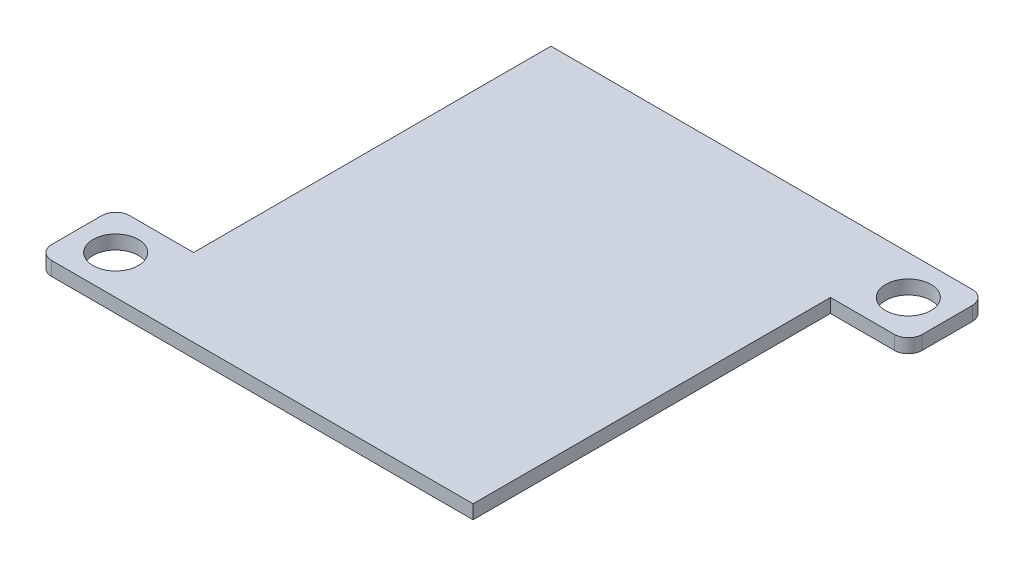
from build123d import *

# Parameters (mm, degrees)
SKETCH1_R           = 1.63
BOSS_EXTRUDE1_DEPTH = 1
FILLET1_R           = 1


with BuildPart() as part:
    # Sketch1 → Boss-Extrude1 (new body)
    with BuildSketch(Plane(origin=(0, 0, 0), x_dir=(1, 0, 0), z_dir=(0, 1, 0))):
        Polygon((12.963481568, -15.78820907), (-13.296518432, -15.78820907), (-18.336518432, -15.78820907), (-18.336518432, -10.18820907), (-12.736518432, -10.18820907), (-12.736518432, 15.51179093), (12.963481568, 15.51179093), (18.563481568, 15.51179093), (18.563481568, 9.91179093), (12.963481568, 9.91179093), align=None)
        with Locations(Location((15.763481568, 12.71179093, 0), (0, 0, 270))):
            Circle(SKETCH1_R, mode=Mode.SUBTRACT)
        with Locations(Location((-15.536518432, -12.98820907, 0), (0, 0, 270))):
            Circle(SKETCH1_R, mode=Mode.SUBTRACT)
    extrude(amount=BOSS_EXTRUDE1_DEPTH)

    # Fillet1
    fillet1_edges = [part.edges().sort_by_distance(p)[0] for p in [
        (18.563481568, 0.5, -15.51179093),
        (18.563481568, 0.5, -9.91179093),
        (-18.336518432, 0.5, 15.78820907),
        (-18.336518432, 0.5, 10.18820907),
    ]]
    fillet(fillet1_edges, radius=FILLET1_R)


solid = part.part
